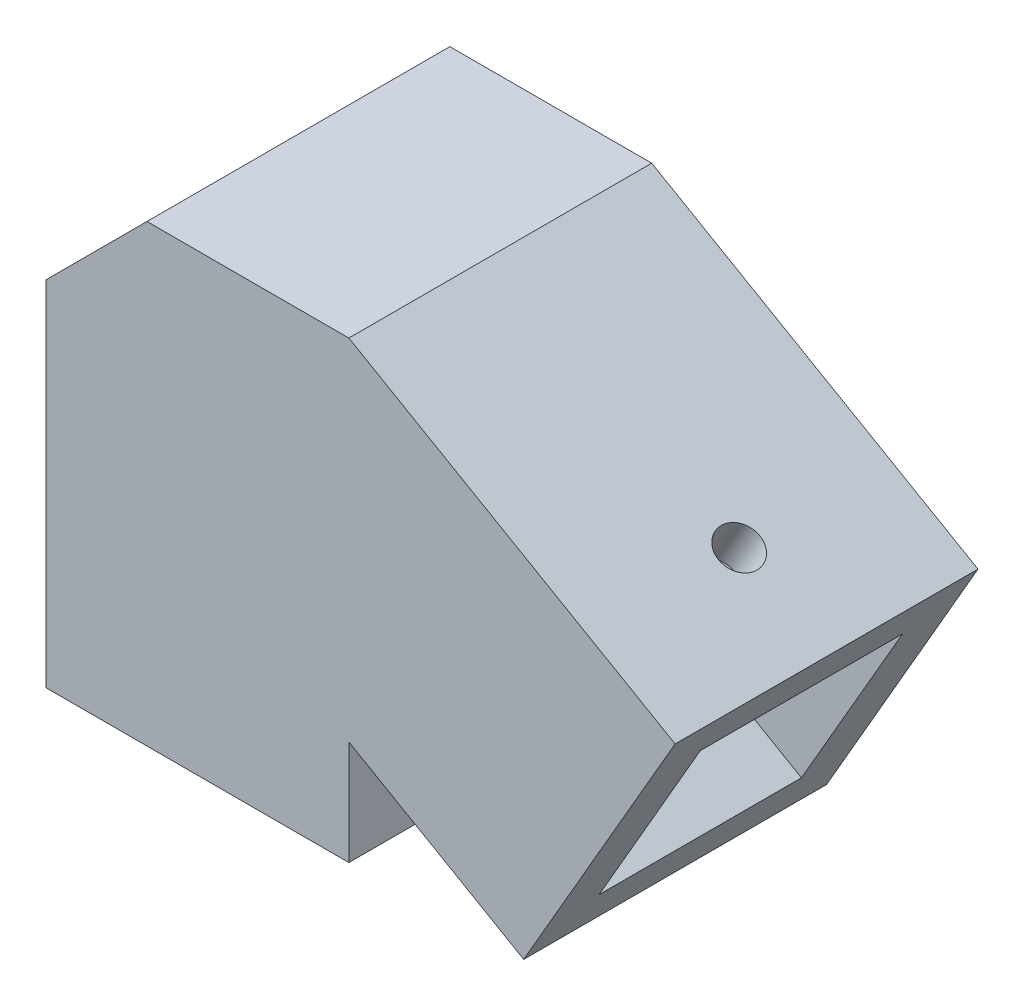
from build123d import *

# Parameters (mm, degrees)
SALIENTE_EXTRUIR1_DEPTH      = 20
SALIENTE_EXTRUIR1_DEPTH_BACK = 25
CROQUIS2_W                   = 30
CROQUIS2_H                   = 30
SALIENTE_EXTRUIR2_DEPTH      = 30
CROQUIS4_W                   = 20.05
CROQUIS4_H                   = 20.05
CORTAR_EXTRUIR1_DEPTH        = 20
CROQUIS5_W                   = 20.05
CROQUIS5_H                   = 20.05
CORTAR_EXTRUIR2_DEPTH        = 23
CHAFL_N1_SIZE                = 10
CROQUIS6_R                   = 2.05
CORTAR_EXTRUIR3_DEPTH        = 4.975
CROQUIS7_R                   = 2.05
CORTAR_EXTRUIR4_DEPTH        = 4.975


with BuildPart() as part:
    # Croquis2 → Saliente-Extruir1 (new, two sides: drawn at the far end of the back side and taken through both)
    with BuildSketch(Plane(origin=(0, 0, 0), x_dir=(1, 0, 0), z_dir=(0, 1, 0)).offset(-SALIENTE_EXTRUIR1_DEPTH_BACK)):
        Rectangle(CROQUIS2_W, CROQUIS2_H)
    extrude(amount=SALIENTE_EXTRUIR1_DEPTH + SALIENTE_EXTRUIR1_DEPTH_BACK)

    # Croquis3 → Saliente-Extruir2 (add)
    with BuildSketch(Plane.XY.offset(15)):
        Polygon((15, 20), (47.320508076, 1.339745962), (32.320508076, -24.641016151), (15, -14.641016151), align=None)
    extrude(amount=-SALIENTE_EXTRUIR2_DEPTH)

    # Croquis4 → Cortar-Extruir1 (cut)
    with BuildSketch(Plane.XZ.offset(25)):
        Rectangle(CROQUIS4_W, CROQUIS4_H)
    extrude(amount=-CORTAR_EXTRUIR1_DEPTH, mode=Mode.SUBTRACT)

    # Croquis5 → Cortar-Extruir2 (cut)
    with BuildSketch(Plane(origin=(34.910254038, -20.155444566, 0), x_dir=(0, 0, -1), z_dir=(0.8660254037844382, -0.5000000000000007, 0))):
        with Locations((0, 9.820508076)):
            Rectangle(CROQUIS5_W, CROQUIS5_H)
    extrude(amount=-CORTAR_EXTRUIR2_DEPTH, mode=Mode.SUBTRACT)

    # Chafl_n1
    chafl_n1_edges = [part.edges().sort_by_distance(p)[0] for p in [
        (-15, 20, 0),
    ]]
    chamfer(chafl_n1_edges, length=CHAFL_N1_SIZE)

    # Croquis6 → Cortar-Extruir3 (cut)
    with BuildSketch(Plane(origin=(12.410254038, 21.495190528, 0), x_dir=(0, 0, -1), z_dir=(0.500000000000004, 0.8660254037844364, 0))):
        with Locations(Location((0, -30.310889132, 0), (0, 0, 90))):
            Circle(CROQUIS6_R)
    extrude(amount=-CORTAR_EXTRUIR3_DEPTH, mode=Mode.SUBTRACT)

    # Croquis7 → Cortar-Extruir4 (cut)
    with BuildSketch(Plane.ZY.offset(15)):
        with Locations((0, -15)):
            Circle(CROQUIS7_R)
    extrude(amount=-CORTAR_EXTRUIR4_DEPTH, mode=Mode.SUBTRACT)


solid = part.part
